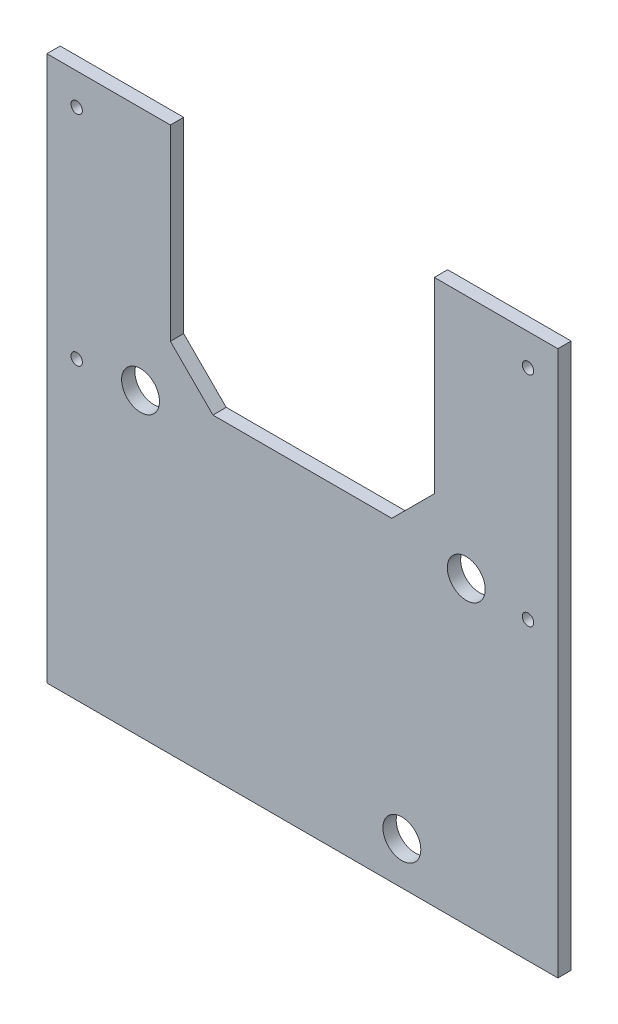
from build123d import *

# Parameters (mm, degrees)
EXTRUDE1_DEPTH              = 0.79375
SKETCH2_W                   = 30.48
SKETCH2_H                   = 9.398
CUT_EXTRUDE1_DEPTH          = 26.412399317
SKETCH3_W                   = 15.748
SKETCH3_H                   = 13.716
CUT_EXTRUDE2_DEPTH          = 26.412399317
SKETCH4_W                   = 30.48
SKETCH4_H                   = 0.79375
EXTRUDE2_DEPTH              = 6.35
F_43_0_089_DIAMETER_HOLE1_D = 2.2606
SKETCH7_R                   = 0.339377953
CUT_EXTRUDE3_DEPTH          = 31.727455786
CHAMFER2_SIZE               = 2.54


with BuildPart() as part:
    # Sketch1 → Extrude1 (new body)
    with BuildSketch(Plane.XY):
        Polygon((15.24, -15.24), (15.24, -20.32), (-15.24, -20.32), (-15.24, -15.24), (-15.24, 15.24), (15.24, 15.24), align=None)
    extrude(amount=EXTRUDE1_DEPTH)

    # Sketch2 → Cut-Extrude1 (cut, through all)
    with BuildSketch(Plane.XY.offset(0.79375)):
        with Locations((0, 10.541)):
            Rectangle(SKETCH2_W, SKETCH2_H)
    extrude(amount=-CUT_EXTRUDE1_DEPTH, mode=Mode.SUBTRACT)

    # Sketch3 → Cut-Extrude2 (cut, through all)
    with BuildSketch(Plane.XY.offset(0.79375)):
        with Locations((0, -1.016)):
            Rectangle(SKETCH3_W, SKETCH3_H)
    extrude(amount=-CUT_EXTRUDE2_DEPTH, mode=Mode.SUBTRACT)

    # Sketch4 → Extrude2 (add)
    with BuildSketch(Plane.XZ.offset(20.32)):
        with Locations((0, 0.396875)):
            Rectangle(SKETCH4_W, SKETCH4_H)
    extrude(amount=EXTRUDE2_DEPTH)

    # 43 _0.089_ Diameter Hole1 (through all)
    with Locations(Plane.XY.offset(0.79375)):
        with Locations((9.779, -8.763), (5.93598, -24.13), (-9.652, -8.763)):
            Hole(F_43_0_089_DIAMETER_HOLE1_D / 2)

    # Sketch7 → Cut-Extrude3 (cut, through all)
    with BuildSketch(Plane.XY.offset(0.79375)):
        with Locations((13.462, -9.04)):
            Circle(SKETCH7_R)
        with Locations((13.462, 3.96)):
            Circle(SKETCH7_R)
        with Locations((-13.462, 3.96)):
            Circle(SKETCH7_R)
        with Locations((-13.462, -9.04)):
            Circle(SKETCH7_R)
    extrude(amount=-CUT_EXTRUDE3_DEPTH, mode=Mode.SUBTRACT)

    # Chamfer2
    chamfer2_edges = [part.edges().sort_by_distance(p)[0] for p in [
        (-7.874, -7.874, 0.396875),
        (7.874, -7.874, 0.396875),
    ]]
    chamfer(chamfer2_edges, length=CHAMFER2_SIZE)


solid = part.part
